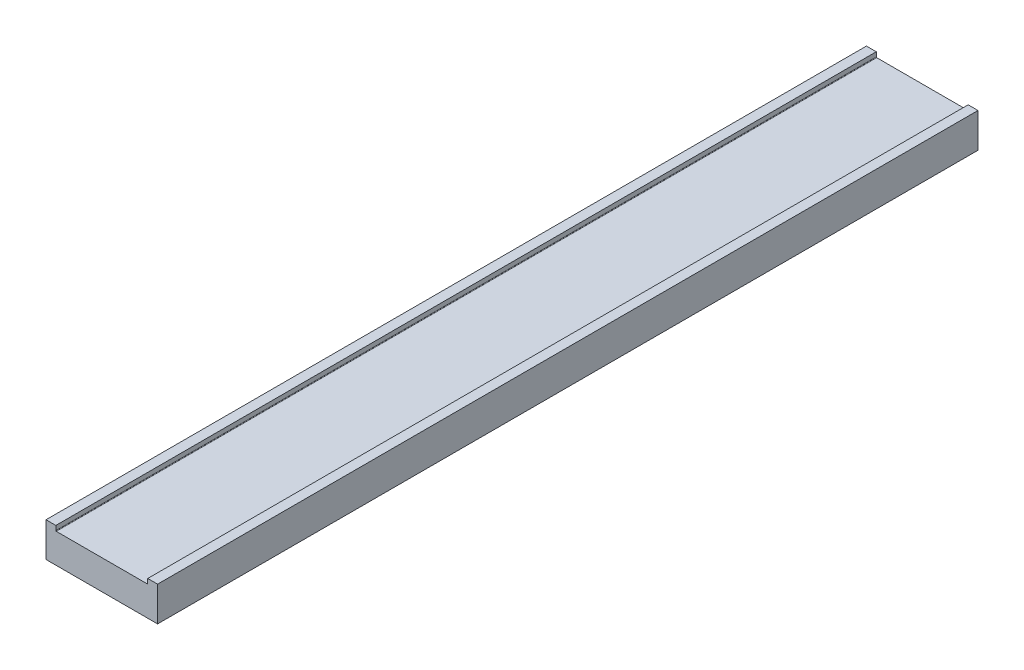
ISO-10303-21;
HEADER;
FILE_DESCRIPTION(('STEP AP214'),'2;1');
FILE_NAME('part.step','',(''),(''),'','','');
FILE_SCHEMA(('AUTOMOTIVE_DESIGN { 1 0 10303 214 1 1 1 1 }'));
ENDSEC;
DATA;
#1=APPLICATION_CONTEXT('core data for automotive mechanical design processes');
#2=APPLICATION_PROTOCOL_DEFINITION('international standard','automotive_design',2000,#1);
#3=PRODUCT_CONTEXT('',#1,'mechanical');
#4=PRODUCT('Part','Part','',(#3));
#5=PRODUCT_RELATED_PRODUCT_CATEGORY('part','',(#4));
#6=PRODUCT_DEFINITION_FORMATION('','',#4);
#7=PRODUCT_DEFINITION_CONTEXT('part definition',#1,'design');
#8=PRODUCT_DEFINITION('design','',#6,#7);
#9=PRODUCT_DEFINITION_SHAPE('','',#8);
#10=(LENGTH_UNIT() NAMED_UNIT(*) SI_UNIT(.MILLI.,.METRE.));
#11=(NAMED_UNIT(*) PLANE_ANGLE_UNIT() SI_UNIT($,.RADIAN.));
#12=(NAMED_UNIT(*) SI_UNIT($,.STERADIAN.) SOLID_ANGLE_UNIT());
#13=UNCERTAINTY_MEASURE_WITH_UNIT(LENGTH_MEASURE(1.E-05),#10,'distance_accuracy_value','');
#14=(GEOMETRIC_REPRESENTATION_CONTEXT(3) GLOBAL_UNCERTAINTY_ASSIGNED_CONTEXT((#13)) GLOBAL_UNIT_ASSIGNED_CONTEXT((#10,
#11,#12)) REPRESENTATION_CONTEXT('',''));
#15=CARTESIAN_POINT('',(0.,0.,0.));
#16=DIRECTION('',(0.,0.,1.));
#17=DIRECTION('',(1.,0.,0.));
#18=AXIS2_PLACEMENT_3D('',#15,#16,#17);
#19=CARTESIAN_POINT('',(28.,21.,0.));
#20=DIRECTION('',(0.,-1.,0.));
#21=DIRECTION('',(1.,0.,0.));
#22=AXIS2_PLACEMENT_3D('',#19,#20,#21);
#23=PLANE('',#22);
#24=DIRECTION('',(1.,0.,0.));
#25=VECTOR('',#24,1.);
#26=CARTESIAN_POINT('',(28.,21.,500.));
#27=LINE('',#26,#25);
#28=CARTESIAN_POINT('',(28.,21.,500.));
#29=VERTEX_POINT('',#28);
#30=CARTESIAN_POINT('',(34.,21.,500.));
#31=VERTEX_POINT('',#30);
#32=EDGE_CURVE('E123',#29,#31,#27,.T.);
#33=ORIENTED_EDGE('',*,*,#32,.T.);
#34=DIRECTION('',(0.,0.,1.));
#35=VECTOR('',#34,1.);
#36=CARTESIAN_POINT('',(34.,21.,0.));
#37=LINE('',#36,#35);
#38=CARTESIAN_POINT('',(34.,21.,0.));
#39=VERTEX_POINT('',#38);
#40=EDGE_CURVE('E9',#39,#31,#37,.T.);
#41=ORIENTED_EDGE('',*,*,#40,.F.);
#42=DIRECTION('',(1.,0.,0.));
#43=VECTOR('',#42,1.);
#44=CARTESIAN_POINT('',(28.,21.,0.));
#45=LINE('',#44,#43);
#46=CARTESIAN_POINT('',(28.,21.,0.));
#47=VERTEX_POINT('',#46);
#48=EDGE_CURVE('E146',#47,#39,#45,.T.);
#49=ORIENTED_EDGE('',*,*,#48,.F.);
#50=DIRECTION('',(0.,0.,1.));
#51=VECTOR('',#50,1.);
#52=CARTESIAN_POINT('',(28.,21.,0.));
#53=LINE('',#52,#51);
#54=EDGE_CURVE('E30',#47,#29,#53,.T.);
#55=ORIENTED_EDGE('',*,*,#54,.T.);
#56=EDGE_LOOP('',(#33,#41,#49,#55));
#57=FACE_BOUND('',#56,.T.);
#58=ADVANCED_FACE('F14',(#57),#23,.F.);
#59=CARTESIAN_POINT('',(34.,21.,0.));
#60=DIRECTION('',(-1.,0.,0.));
#61=DIRECTION('',(0.,0.,1.));
#62=AXIS2_PLACEMENT_3D('',#59,#60,#61);
#63=PLANE('',#62);
#64=DIRECTION('',(0.,-1.,0.));
#65=VECTOR('',#64,1.);
#66=CARTESIAN_POINT('',(34.,21.,500.));
#67=LINE('',#66,#65);
#68=CARTESIAN_POINT('',(34.,0.,500.));
#69=VERTEX_POINT('',#68);
#70=EDGE_CURVE('E125',#31,#69,#67,.T.);
#71=ORIENTED_EDGE('',*,*,#70,.T.);
#72=DIRECTION('',(0.,0.,1.));
#73=VECTOR('',#72,1.);
#74=CARTESIAN_POINT('',(34.,0.,0.));
#75=LINE('',#74,#73);
#76=CARTESIAN_POINT('',(34.,0.,0.));
#77=VERTEX_POINT('',#76);
#78=EDGE_CURVE('E22',#77,#69,#75,.T.);
#79=ORIENTED_EDGE('',*,*,#78,.F.);
#80=DIRECTION('',(0.,-1.,0.));
#81=VECTOR('',#80,1.);
#82=CARTESIAN_POINT('',(34.,21.,0.));
#83=LINE('',#82,#81);
#84=EDGE_CURVE('E75',#39,#77,#83,.T.);
#85=ORIENTED_EDGE('',*,*,#84,.F.);
#86=ORIENTED_EDGE('',*,*,#40,.T.);
#87=EDGE_LOOP('',(#71,#79,#85,#86));
#88=FACE_BOUND('',#87,.T.);
#89=ADVANCED_FACE('F165',(#88),#63,.F.);
#90=CARTESIAN_POINT('',(-34.,0.,0.));
#91=DIRECTION('',(0.,-1.,0.));
#92=DIRECTION('',(0.,0.,-1.));
#93=AXIS2_PLACEMENT_3D('',#90,#91,#92);
#94=PLANE('',#93);
#95=DIRECTION('',(1.,0.,0.));
#96=VECTOR('',#95,1.);
#97=CARTESIAN_POINT('',(-34.,0.,500.));
#98=LINE('',#97,#96);
#99=CARTESIAN_POINT('',(-34.,0.,500.));
#100=VERTEX_POINT('',#99);
#101=EDGE_CURVE('E128',#100,#69,#98,.T.);
#102=ORIENTED_EDGE('',*,*,#101,.F.);
#103=DIRECTION('',(0.,0.,1.));
#104=VECTOR('',#103,1.);
#105=CARTESIAN_POINT('',(-34.,0.,0.));
#106=LINE('',#105,#104);
#107=CARTESIAN_POINT('',(-34.,0.,0.));
#108=VERTEX_POINT('',#107);
#109=EDGE_CURVE('E158',#108,#100,#106,.T.);
#110=ORIENTED_EDGE('',*,*,#109,.F.);
#111=DIRECTION('',(1.,0.,0.));
#112=VECTOR('',#111,1.);
#113=CARTESIAN_POINT('',(-34.,0.,0.));
#114=LINE('',#113,#112);
#115=EDGE_CURVE('E164',#108,#77,#114,.T.);
#116=ORIENTED_EDGE('',*,*,#115,.T.);
#117=ORIENTED_EDGE('',*,*,#78,.T.);
#118=EDGE_LOOP('',(#102,#110,#116,#117));
#119=FACE_BOUND('',#118,.T.);
#120=ADVANCED_FACE('F162',(#119),#94,.T.);
#121=CARTESIAN_POINT('',(-34.,21.,0.));
#122=DIRECTION('',(-1.,0.,0.));
#123=DIRECTION('',(0.,0.,1.));
#124=AXIS2_PLACEMENT_3D('',#121,#122,#123);
#125=PLANE('',#124);
#126=DIRECTION('',(0.,-1.,0.));
#127=VECTOR('',#126,1.);
#128=CARTESIAN_POINT('',(-34.,21.,500.));
#129=LINE('',#128,#127);
#130=CARTESIAN_POINT('',(-34.,21.,500.));
#131=VERTEX_POINT('',#130);
#132=EDGE_CURVE('E131',#131,#100,#129,.T.);
#133=ORIENTED_EDGE('',*,*,#132,.F.);
#134=DIRECTION('',(0.,0.,1.));
#135=VECTOR('',#134,1.);
#136=CARTESIAN_POINT('',(-34.,21.,0.));
#137=LINE('',#136,#135);
#138=CARTESIAN_POINT('',(-34.,21.,0.));
#139=VERTEX_POINT('',#138);
#140=EDGE_CURVE('E156',#139,#131,#137,.T.);
#141=ORIENTED_EDGE('',*,*,#140,.F.);
#142=DIRECTION('',(0.,-1.,0.));
#143=VECTOR('',#142,1.);
#144=CARTESIAN_POINT('',(-34.,21.,0.));
#145=LINE('',#144,#143);
#146=EDGE_CURVE('E177',#139,#108,#145,.T.);
#147=ORIENTED_EDGE('',*,*,#146,.T.);
#148=ORIENTED_EDGE('',*,*,#109,.T.);
#149=EDGE_LOOP('',(#133,#141,#147,#148));
#150=FACE_BOUND('',#149,.T.);
#151=ADVANCED_FACE('F173',(#150),#125,.T.);
#152=CARTESIAN_POINT('',(-34.,21.,0.));
#153=DIRECTION('',(0.,-1.,0.));
#154=DIRECTION('',(1.,0.,0.));
#155=AXIS2_PLACEMENT_3D('',#152,#153,#154);
#156=PLANE('',#155);
#157=DIRECTION('',(1.,0.,0.));
#158=VECTOR('',#157,1.);
#159=CARTESIAN_POINT('',(-34.,21.,500.));
#160=LINE('',#159,#158);
#161=CARTESIAN_POINT('',(-28.,21.,500.));
#162=VERTEX_POINT('',#161);
#163=EDGE_CURVE('E134',#131,#162,#160,.T.);
#164=ORIENTED_EDGE('',*,*,#163,.T.);
#165=DIRECTION('',(0.,0.,1.));
#166=VECTOR('',#165,1.);
#167=CARTESIAN_POINT('',(-28.,21.,0.));
#168=LINE('',#167,#166);
#169=CARTESIAN_POINT('',(-28.,21.,0.));
#170=VERTEX_POINT('',#169);
#171=EDGE_CURVE('E153',#170,#162,#168,.T.);
#172=ORIENTED_EDGE('',*,*,#171,.F.);
#173=DIRECTION('',(1.,0.,0.));
#174=VECTOR('',#173,1.);
#175=CARTESIAN_POINT('',(-34.,21.,0.));
#176=LINE('',#175,#174);
#177=EDGE_CURVE('E179',#139,#170,#176,.T.);
#178=ORIENTED_EDGE('',*,*,#177,.F.);
#179=ORIENTED_EDGE('',*,*,#140,.T.);
#180=EDGE_LOOP('',(#164,#172,#178,#179));
#181=FACE_BOUND('',#180,.T.);
#182=ADVANCED_FACE('F219',(#181),#156,.F.);
#183=CARTESIAN_POINT('',(-28.,21.,0.));
#184=DIRECTION('',(-1.,0.,0.));
#185=DIRECTION('',(0.,0.,1.));
#186=AXIS2_PLACEMENT_3D('',#183,#184,#185);
#187=PLANE('',#186);
#188=DIRECTION('',(0.,-1.,0.));
#189=VECTOR('',#188,1.);
#190=CARTESIAN_POINT('',(-28.,21.,500.));
#191=LINE('',#190,#189);
#192=CARTESIAN_POINT('',(-28.,18.3,500.));
#193=VERTEX_POINT('',#192);
#194=EDGE_CURVE('E136',#162,#193,#191,.T.);
#195=ORIENTED_EDGE('',*,*,#194,.T.);
#196=DIRECTION('',(0.,0.,1.));
#197=VECTOR('',#196,1.);
#198=CARTESIAN_POINT('',(-28.,18.3,0.));
#199=LINE('',#198,#197);
#200=CARTESIAN_POINT('',(-28.,18.3,0.));
#201=VERTEX_POINT('',#200);
#202=EDGE_CURVE('E150',#201,#193,#199,.T.);
#203=ORIENTED_EDGE('',*,*,#202,.F.);
#204=DIRECTION('',(0.,-1.,0.));
#205=VECTOR('',#204,1.);
#206=CARTESIAN_POINT('',(-28.,21.,0.));
#207=LINE('',#206,#205);
#208=EDGE_CURVE('E185',#170,#201,#207,.T.);
#209=ORIENTED_EDGE('',*,*,#208,.F.);
#210=ORIENTED_EDGE('',*,*,#171,.T.);
#211=EDGE_LOOP('',(#195,#203,#209,#210));
#212=FACE_BOUND('',#211,.T.);
#213=ADVANCED_FACE('F190',(#212),#187,.F.);
#214=CARTESIAN_POINT('',(-27.7,18.3,0.));
#215=DIRECTION('',(0.,0.,1.));
#216=DIRECTION('',(1.,0.,0.));
#217=AXIS2_PLACEMENT_3D('',#214,#215,#216);
#218=CYLINDRICAL_SURFACE('',#217,0.3);
#219=CARTESIAN_POINT('',(-27.7,18.3,500.));
#220=DIRECTION('',(0.,0.,1.));
#221=DIRECTION('',(1.,0.,0.));
#222=AXIS2_PLACEMENT_3D('',#219,#220,#221);
#223=CIRCLE('',#222,0.3);
#224=CARTESIAN_POINT('',(-27.7,18.,500.));
#225=VERTEX_POINT('',#224);
#226=EDGE_CURVE('E138',#193,#225,#223,.T.);
#227=ORIENTED_EDGE('',*,*,#226,.T.);
#228=DIRECTION('',(0.,0.,1.));
#229=VECTOR('',#228,1.);
#230=CARTESIAN_POINT('',(-27.7,18.,0.));
#231=LINE('',#230,#229);
#232=CARTESIAN_POINT('',(-27.7,18.,0.));
#233=VERTEX_POINT('',#232);
#234=EDGE_CURVE('E115',#233,#225,#231,.T.);
#235=ORIENTED_EDGE('',*,*,#234,.F.);
#236=CARTESIAN_POINT('',(-27.7,18.3,0.));
#237=DIRECTION('',(0.,0.,1.));
#238=DIRECTION('',(1.,0.,0.));
#239=AXIS2_PLACEMENT_3D('',#236,#237,#238);
#240=CIRCLE('',#239,0.3);
#241=EDGE_CURVE('E103',#201,#233,#240,.T.);
#242=ORIENTED_EDGE('',*,*,#241,.F.);
#243=ORIENTED_EDGE('',*,*,#202,.T.);
#244=EDGE_LOOP('',(#227,#235,#242,#243));
#245=FACE_BOUND('',#244,.T.);
#246=ADVANCED_FACE('F193',(#245),#218,.F.);
#247=CARTESIAN_POINT('',(-27.7,18.,0.));
#248=DIRECTION('',(0.,-1.,0.));
#249=DIRECTION('',(0.,0.,-1.));
#250=AXIS2_PLACEMENT_3D('',#247,#248,#249);
#251=PLANE('',#250);
#252=DIRECTION('',(1.,0.,0.));
#253=VECTOR('',#252,1.);
#254=CARTESIAN_POINT('',(-27.7,18.,500.));
#255=LINE('',#254,#253);
#256=CARTESIAN_POINT('',(27.7,18.,500.));
#257=VERTEX_POINT('',#256);
#258=EDGE_CURVE('E112',#225,#257,#255,.T.);
#259=ORIENTED_EDGE('',*,*,#258,.T.);
#260=DIRECTION('',(0.,0.,1.));
#261=VECTOR('',#260,1.);
#262=CARTESIAN_POINT('',(27.7,18.,0.));
#263=LINE('',#262,#261);
#264=CARTESIAN_POINT('',(27.7,18.,0.));
#265=VERTEX_POINT('',#264);
#266=EDGE_CURVE('E109',#265,#257,#263,.T.);
#267=ORIENTED_EDGE('',*,*,#266,.F.);
#268=DIRECTION('',(1.,0.,0.));
#269=VECTOR('',#268,1.);
#270=CARTESIAN_POINT('',(-27.7,18.,0.));
#271=LINE('',#270,#269);
#272=EDGE_CURVE('E96',#233,#265,#271,.T.);
#273=ORIENTED_EDGE('',*,*,#272,.F.);
#274=ORIENTED_EDGE('',*,*,#234,.T.);
#275=EDGE_LOOP('',(#259,#267,#273,#274));
#276=FACE_BOUND('',#275,.T.);
#277=ADVANCED_FACE('F110',(#276),#251,.F.);
#278=CARTESIAN_POINT('',(27.7,18.3,0.));
#279=DIRECTION('',(0.,0.,1.));
#280=DIRECTION('',(1.,0.,0.));
#281=AXIS2_PLACEMENT_3D('',#278,#279,#280);
#282=CYLINDRICAL_SURFACE('',#281,0.300000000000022);
#283=CARTESIAN_POINT('',(27.7,18.3,500.));
#284=DIRECTION('',(0.,0.,1.));
#285=DIRECTION('',(1.,0.,0.));
#286=AXIS2_PLACEMENT_3D('',#283,#284,#285);
#287=CIRCLE('',#286,0.300000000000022);
#288=CARTESIAN_POINT('',(28.,18.3,500.));
#289=VERTEX_POINT('',#288);
#290=EDGE_CURVE('E141',#257,#289,#287,.T.);
#291=ORIENTED_EDGE('',*,*,#290,.T.);
#292=DIRECTION('',(0.,0.,1.));
#293=VECTOR('',#292,1.);
#294=CARTESIAN_POINT('',(28.,18.3,0.));
#295=LINE('',#294,#293);
#296=CARTESIAN_POINT('',(28.,18.3,0.));
#297=VERTEX_POINT('',#296);
#298=EDGE_CURVE('E63',#297,#289,#295,.T.);
#299=ORIENTED_EDGE('',*,*,#298,.F.);
#300=CARTESIAN_POINT('',(27.7,18.3,0.));
#301=DIRECTION('',(0.,0.,1.));
#302=DIRECTION('',(1.,0.,0.));
#303=AXIS2_PLACEMENT_3D('',#300,#301,#302);
#304=CIRCLE('',#303,0.300000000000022);
#305=EDGE_CURVE('E101',#265,#297,#304,.T.);
#306=ORIENTED_EDGE('',*,*,#305,.F.);
#307=ORIENTED_EDGE('',*,*,#266,.T.);
#308=EDGE_LOOP('',(#291,#299,#306,#307));
#309=FACE_BOUND('',#308,.T.);
#310=ADVANCED_FACE('F117',(#309),#282,.F.);
#311=CARTESIAN_POINT('',(28.,21.,0.));
#312=DIRECTION('',(-1.,0.,0.));
#313=DIRECTION('',(0.,0.,1.));
#314=AXIS2_PLACEMENT_3D('',#311,#312,#313);
#315=PLANE('',#314);
#316=DIRECTION('',(0.,-1.,0.));
#317=VECTOR('',#316,1.);
#318=CARTESIAN_POINT('',(28.,21.,500.));
#319=LINE('',#318,#317);
#320=EDGE_CURVE('E143',#29,#289,#319,.T.);
#321=ORIENTED_EDGE('',*,*,#320,.F.);
#322=ORIENTED_EDGE('',*,*,#54,.F.);
#323=DIRECTION('',(0.,-1.,0.));
#324=VECTOR('',#323,1.);
#325=CARTESIAN_POINT('',(28.,21.,0.));
#326=LINE('',#325,#324);
#327=EDGE_CURVE('E118',#47,#297,#326,.T.);
#328=ORIENTED_EDGE('',*,*,#327,.T.);
#329=ORIENTED_EDGE('',*,*,#298,.T.);
#330=EDGE_LOOP('',(#321,#322,#328,#329));
#331=FACE_BOUND('',#330,.T.);
#332=ADVANCED_FACE('F194',(#331),#315,.T.);
#333=CARTESIAN_POINT('',(-27.7,18.3,0.));
#334=DIRECTION('',(0.,0.,1.));
#335=DIRECTION('',(1.,0.,0.));
#336=AXIS2_PLACEMENT_3D('',#333,#334,#335);
#337=PLANE('',#336);
#338=ORIENTED_EDGE('',*,*,#48,.T.);
#339=ORIENTED_EDGE('',*,*,#84,.T.);
#340=ORIENTED_EDGE('',*,*,#115,.F.);
#341=ORIENTED_EDGE('',*,*,#146,.F.);
#342=ORIENTED_EDGE('',*,*,#177,.T.);
#343=ORIENTED_EDGE('',*,*,#208,.T.);
#344=ORIENTED_EDGE('',*,*,#241,.T.);
#345=ORIENTED_EDGE('',*,*,#272,.T.);
#346=ORIENTED_EDGE('',*,*,#305,.T.);
#347=ORIENTED_EDGE('',*,*,#327,.F.);
#348=EDGE_LOOP('',(#338,#339,#340,#341,#342,#343,#344,#345,#346,#347));
#349=FACE_BOUND('',#348,.T.);
#350=ADVANCED_FACE('F98',(#349),#337,.F.);
#351=CARTESIAN_POINT('',(-27.7,18.3,500.));
#352=DIRECTION('',(0.,0.,1.));
#353=DIRECTION('',(1.,0.,0.));
#354=AXIS2_PLACEMENT_3D('',#351,#352,#353);
#355=PLANE('',#354);
#356=ORIENTED_EDGE('',*,*,#32,.F.);
#357=ORIENTED_EDGE('',*,*,#320,.T.);
#358=ORIENTED_EDGE('',*,*,#290,.F.);
#359=ORIENTED_EDGE('',*,*,#258,.F.);
#360=ORIENTED_EDGE('',*,*,#226,.F.);
#361=ORIENTED_EDGE('',*,*,#194,.F.);
#362=ORIENTED_EDGE('',*,*,#163,.F.);
#363=ORIENTED_EDGE('',*,*,#132,.T.);
#364=ORIENTED_EDGE('',*,*,#101,.T.);
#365=ORIENTED_EDGE('',*,*,#70,.F.);
#366=EDGE_LOOP('',(#356,#357,#358,#359,#360,#361,#362,#363,#364,#365));
#367=FACE_BOUND('',#366,.T.);
#368=ADVANCED_FACE('F168',(#367),#355,.T.);
#369=CLOSED_SHELL('',(#58,#89,#120,#151,#182,#213,#246,#277,#310,#332,#350,#368));
#370=MANIFOLD_SOLID_BREP('B1',#369);
#371=ADVANCED_BREP_SHAPE_REPRESENTATION('',(#18,#370),#14);
#372=SHAPE_DEFINITION_REPRESENTATION(#9,#371);
ENDSEC;
END-ISO-10303-21;
